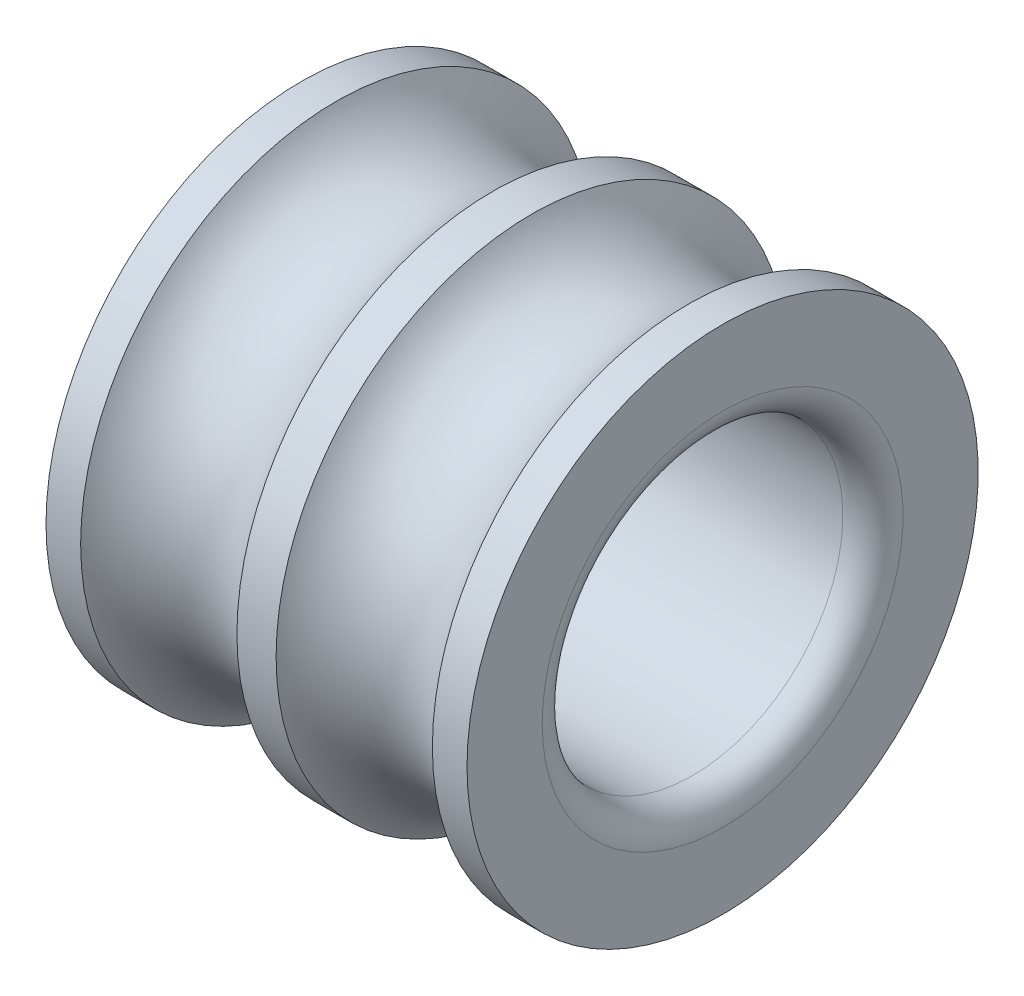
ISO-10303-21;
HEADER;
FILE_DESCRIPTION(('STEP AP214'),'2;1');
FILE_NAME('part.step','',(''),(''),'','','');
FILE_SCHEMA(('AUTOMOTIVE_DESIGN { 1 0 10303 214 1 1 1 1 }'));
ENDSEC;
DATA;
#1=APPLICATION_CONTEXT('core data for automotive mechanical design processes');
#2=APPLICATION_PROTOCOL_DEFINITION('international standard','automotive_design',2000,#1);
#3=PRODUCT_CONTEXT('',#1,'mechanical');
#4=PRODUCT('Part','Part','',(#3));
#5=PRODUCT_RELATED_PRODUCT_CATEGORY('part','',(#4));
#6=PRODUCT_DEFINITION_FORMATION('','',#4);
#7=PRODUCT_DEFINITION_CONTEXT('part definition',#1,'design');
#8=PRODUCT_DEFINITION('design','',#6,#7);
#9=PRODUCT_DEFINITION_SHAPE('','',#8);
#10=(LENGTH_UNIT() NAMED_UNIT(*) SI_UNIT(.MILLI.,.METRE.));
#11=(NAMED_UNIT(*) PLANE_ANGLE_UNIT() SI_UNIT($,.RADIAN.));
#12=(NAMED_UNIT(*) SI_UNIT($,.STERADIAN.) SOLID_ANGLE_UNIT());
#13=UNCERTAINTY_MEASURE_WITH_UNIT(LENGTH_MEASURE(1.E-05),#10,'distance_accuracy_value','');
#14=(GEOMETRIC_REPRESENTATION_CONTEXT(3) GLOBAL_UNCERTAINTY_ASSIGNED_CONTEXT((#13)) GLOBAL_UNIT_ASSIGNED_CONTEXT((#10,
#11,#12)) REPRESENTATION_CONTEXT('',''));
#15=CARTESIAN_POINT('',(0.,0.,0.));
#16=DIRECTION('',(0.,0.,1.));
#17=DIRECTION('',(1.,0.,0.));
#18=AXIS2_PLACEMENT_3D('',#15,#16,#17);
#19=CARTESIAN_POINT('',(3.75,0.,0.));
#20=DIRECTION('',(-1.,0.,0.));
#21=DIRECTION('',(0.,0.,1.));
#22=AXIS2_PLACEMENT_3D('',#19,#20,#21);
#23=TOROIDAL_SURFACE('',#22,10.,3.);
#24=CARTESIAN_POINT('',(1.15192378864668,0.,0.));
#25=DIRECTION('',(-1.,0.,0.));
#26=DIRECTION('',(0.,0.,1.));
#27=AXIS2_PLACEMENT_3D('',#24,#25,#26);
#28=CIRCLE('',#27,8.5);
#29=CARTESIAN_POINT('',(1.15192378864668,0.,8.5));
#30=VERTEX_POINT('',#29);
#31=EDGE_CURVE('E49',#30,#30,#28,.T.);
#32=ORIENTED_EDGE('',*,*,#31,.F.);
#33=EDGE_LOOP('',(#32));
#34=FACE_BOUND('',#33,.T.);
#35=CARTESIAN_POINT('',(6.34807621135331,0.,0.));
#36=DIRECTION('',(-1.,0.,0.));
#37=DIRECTION('',(0.,0.,1.));
#38=AXIS2_PLACEMENT_3D('',#35,#36,#37);
#39=CIRCLE('',#38,8.5);
#40=CARTESIAN_POINT('',(6.34807621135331,0.,8.5));
#41=VERTEX_POINT('',#40);
#42=EDGE_CURVE('E64',#41,#41,#39,.T.);
#43=ORIENTED_EDGE('',*,*,#42,.T.);
#44=EDGE_LOOP('',(#43));
#45=FACE_BOUND('',#44,.T.);
#46=ADVANCED_FACE('F30',(#34,#45),#23,.F.);
#47=CARTESIAN_POINT('',(0.,0.,0.));
#48=DIRECTION('',(-1.,0.,0.));
#49=DIRECTION('',(0.,0.,1.));
#50=AXIS2_PLACEMENT_3D('',#47,#48,#49);
#51=CYLINDRICAL_SURFACE('',#50,8.5);
#52=CARTESIAN_POINT('',(0.,0.,0.));
#53=DIRECTION('',(-1.,0.,0.));
#54=DIRECTION('',(0.,0.,1.));
#55=AXIS2_PLACEMENT_3D('',#52,#53,#54);
#56=CIRCLE('',#55,8.5);
#57=CARTESIAN_POINT('',(0.,0.,8.5));
#58=VERTEX_POINT('',#57);
#59=EDGE_CURVE('E52',#58,#58,#56,.T.);
#60=ORIENTED_EDGE('',*,*,#59,.F.);
#61=EDGE_LOOP('',(#60));
#62=FACE_BOUND('',#61,.T.);
#63=ORIENTED_EDGE('',*,*,#31,.T.);
#64=EDGE_LOOP('',(#63));
#65=FACE_BOUND('',#64,.T.);
#66=ADVANCED_FACE('F99',(#62,#65),#51,.T.);
#67=CARTESIAN_POINT('',(0.,8.5,0.));
#68=DIRECTION('',(1.,0.,0.));
#69=DIRECTION('',(0.,0.,-1.));
#70=AXIS2_PLACEMENT_3D('',#67,#68,#69);
#71=PLANE('',#70);
#72=CARTESIAN_POINT('',(0.,0.,0.));
#73=DIRECTION('',(1.,0.,0.));
#74=DIRECTION('',(0.,0.,-1.));
#75=AXIS2_PLACEMENT_3D('',#72,#73,#74);
#76=CIRCLE('',#75,6.);
#77=CARTESIAN_POINT('',(0.,0.,-6.));
#78=VERTEX_POINT('',#77);
#79=EDGE_CURVE('E10',#78,#78,#76,.T.);
#80=ORIENTED_EDGE('',*,*,#79,.T.);
#81=EDGE_LOOP('',(#80));
#82=FACE_BOUND('',#81,.T.);
#83=ORIENTED_EDGE('',*,*,#59,.T.);
#84=EDGE_LOOP('',(#83));
#85=FACE_BOUND('',#84,.T.);
#86=ADVANCED_FACE('F96',(#82,#85),#71,.F.);
#87=CARTESIAN_POINT('',(0.,0.,0.));
#88=DIRECTION('',(-1.,0.,0.));
#89=DIRECTION('',(0.,0.,1.));
#90=AXIS2_PLACEMENT_3D('',#87,#88,#89);
#91=CYLINDRICAL_SURFACE('',#90,5.);
#92=CARTESIAN_POINT('',(13.,0.,0.));
#93=DIRECTION('',(-1.,0.,0.));
#94=DIRECTION('',(0.,0.,1.));
#95=AXIS2_PLACEMENT_3D('',#92,#93,#94);
#96=CIRCLE('',#95,5.);
#97=CARTESIAN_POINT('',(13.,0.,5.));
#98=VERTEX_POINT('',#97);
#99=EDGE_CURVE('E36',#98,#98,#96,.F.);
#100=ORIENTED_EDGE('',*,*,#99,.T.);
#101=EDGE_LOOP('',(#100));
#102=FACE_BOUND('',#101,.T.);
#103=CARTESIAN_POINT('',(1.,0.,0.));
#104=DIRECTION('',(1.,0.,0.));
#105=DIRECTION('',(0.,0.,-1.));
#106=AXIS2_PLACEMENT_3D('',#103,#104,#105);
#107=CIRCLE('',#106,5.);
#108=CARTESIAN_POINT('',(1.,0.,-5.));
#109=VERTEX_POINT('',#108);
#110=EDGE_CURVE('E40',#109,#109,#107,.F.);
#111=ORIENTED_EDGE('',*,*,#110,.T.);
#112=EDGE_LOOP('',(#111));
#113=FACE_BOUND('',#112,.T.);
#114=ADVANCED_FACE('F90',(#102,#113),#91,.F.);
#115=CARTESIAN_POINT('',(14.,5.,0.));
#116=DIRECTION('',(-1.,0.,0.));
#117=DIRECTION('',(0.,0.,1.));
#118=AXIS2_PLACEMENT_3D('',#115,#116,#117);
#119=PLANE('',#118);
#120=CARTESIAN_POINT('',(14.,0.,0.));
#121=DIRECTION('',(-1.,0.,0.));
#122=DIRECTION('',(0.,0.,1.));
#123=AXIS2_PLACEMENT_3D('',#120,#121,#122);
#124=CIRCLE('',#123,6.);
#125=CARTESIAN_POINT('',(14.,0.,6.));
#126=VERTEX_POINT('',#125);
#127=EDGE_CURVE('E44',#126,#126,#124,.T.);
#128=ORIENTED_EDGE('',*,*,#127,.T.);
#129=EDGE_LOOP('',(#128));
#130=FACE_BOUND('',#129,.T.);
#131=CARTESIAN_POINT('',(14.,0.,0.));
#132=DIRECTION('',(-1.,0.,0.));
#133=DIRECTION('',(0.,0.,1.));
#134=AXIS2_PLACEMENT_3D('',#131,#132,#133);
#135=CIRCLE('',#134,8.5);
#136=CARTESIAN_POINT('',(14.,0.,8.5));
#137=VERTEX_POINT('',#136);
#138=EDGE_CURVE('E55',#137,#137,#135,.T.);
#139=ORIENTED_EDGE('',*,*,#138,.F.);
#140=EDGE_LOOP('',(#139));
#141=FACE_BOUND('',#140,.T.);
#142=ADVANCED_FACE('F85',(#130,#141),#119,.F.);
#143=CARTESIAN_POINT('',(0.,0.,0.));
#144=DIRECTION('',(-1.,0.,0.));
#145=DIRECTION('',(0.,0.,1.));
#146=AXIS2_PLACEMENT_3D('',#143,#144,#145);
#147=CYLINDRICAL_SURFACE('',#146,8.5);
#148=CARTESIAN_POINT('',(12.8480762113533,0.,0.));
#149=DIRECTION('',(-1.,0.,0.));
#150=DIRECTION('',(0.,0.,1.));
#151=AXIS2_PLACEMENT_3D('',#148,#149,#150);
#152=CIRCLE('',#151,8.5);
#153=CARTESIAN_POINT('',(12.8480762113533,0.,8.5));
#154=VERTEX_POINT('',#153);
#155=EDGE_CURVE('E58',#154,#154,#152,.T.);
#156=ORIENTED_EDGE('',*,*,#155,.F.);
#157=EDGE_LOOP('',(#156));
#158=FACE_BOUND('',#157,.T.);
#159=ORIENTED_EDGE('',*,*,#138,.T.);
#160=EDGE_LOOP('',(#159));
#161=FACE_BOUND('',#160,.T.);
#162=ADVANCED_FACE('F79',(#158,#161),#147,.T.);
#163=CARTESIAN_POINT('',(10.25,0.,0.));
#164=DIRECTION('',(-1.,0.,0.));
#165=DIRECTION('',(0.,0.,1.));
#166=AXIS2_PLACEMENT_3D('',#163,#164,#165);
#167=TOROIDAL_SURFACE('',#166,10.,3.);
#168=CARTESIAN_POINT('',(7.65192378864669,0.,0.));
#169=DIRECTION('',(-1.,0.,0.));
#170=DIRECTION('',(0.,0.,1.));
#171=AXIS2_PLACEMENT_3D('',#168,#169,#170);
#172=CIRCLE('',#171,8.5);
#173=CARTESIAN_POINT('',(7.65192378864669,0.,8.5));
#174=VERTEX_POINT('',#173);
#175=EDGE_CURVE('E61',#174,#174,#172,.T.);
#176=ORIENTED_EDGE('',*,*,#175,.F.);
#177=EDGE_LOOP('',(#176));
#178=FACE_BOUND('',#177,.T.);
#179=ORIENTED_EDGE('',*,*,#155,.T.);
#180=EDGE_LOOP('',(#179));
#181=FACE_BOUND('',#180,.T.);
#182=ADVANCED_FACE('F73',(#178,#181),#167,.F.);
#183=CARTESIAN_POINT('',(0.,0.,0.));
#184=DIRECTION('',(-1.,0.,0.));
#185=DIRECTION('',(0.,0.,1.));
#186=AXIS2_PLACEMENT_3D('',#183,#184,#185);
#187=CYLINDRICAL_SURFACE('',#186,8.5);
#188=ORIENTED_EDGE('',*,*,#42,.F.);
#189=EDGE_LOOP('',(#188));
#190=FACE_BOUND('',#189,.T.);
#191=ORIENTED_EDGE('',*,*,#175,.T.);
#192=EDGE_LOOP('',(#191));
#193=FACE_BOUND('',#192,.T.);
#194=ADVANCED_FACE('F69',(#190,#193),#187,.T.);
#195=CARTESIAN_POINT('',(13.,0.,0.));
#196=DIRECTION('',(-1.,0.,0.));
#197=DIRECTION('',(0.,0.,1.));
#198=AXIS2_PLACEMENT_3D('',#195,#196,#197);
#199=TOROIDAL_SURFACE('',#198,6.,1.);
#200=ORIENTED_EDGE('',*,*,#99,.F.);
#201=EDGE_LOOP('',(#200));
#202=FACE_BOUND('',#201,.T.);
#203=ORIENTED_EDGE('',*,*,#127,.F.);
#204=EDGE_LOOP('',(#203));
#205=FACE_BOUND('',#204,.T.);
#206=ADVANCED_FACE('F72',(#202,#205),#199,.T.);
#207=CARTESIAN_POINT('',(1.,0.,0.));
#208=DIRECTION('',(1.,0.,0.));
#209=DIRECTION('',(0.,0.,-1.));
#210=AXIS2_PLACEMENT_3D('',#207,#208,#209);
#211=TOROIDAL_SURFACE('',#210,6.,1.);
#212=ORIENTED_EDGE('',*,*,#79,.F.);
#213=EDGE_LOOP('',(#212));
#214=FACE_BOUND('',#213,.T.);
#215=ORIENTED_EDGE('',*,*,#110,.F.);
#216=EDGE_LOOP('',(#215));
#217=FACE_BOUND('',#216,.T.);
#218=ADVANCED_FACE('F134',(#214,#217),#211,.T.);
#219=CLOSED_SHELL('',(#46,#66,#86,#114,#142,#162,#182,#194,#206,#218));
#220=MANIFOLD_SOLID_BREP('B2',#219);
#221=ADVANCED_BREP_SHAPE_REPRESENTATION('',(#18,#220),#14);
#222=SHAPE_DEFINITION_REPRESENTATION(#9,#221);
ENDSEC;
END-ISO-10303-21;
